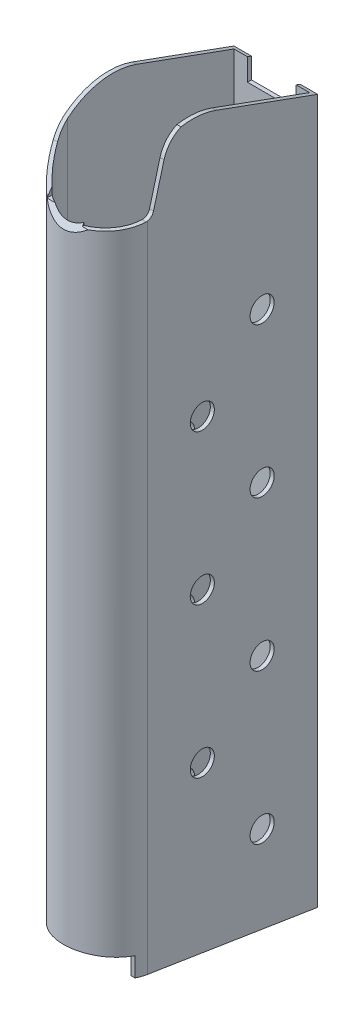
ISO-10303-21;
HEADER;
FILE_DESCRIPTION(('STEP AP214'),'2;1');
FILE_NAME('part.step','',(''),(''),'','','');
FILE_SCHEMA(('AUTOMOTIVE_DESIGN { 1 0 10303 214 1 1 1 1 }'));
ENDSEC;
DATA;
#1=APPLICATION_CONTEXT('core data for automotive mechanical design processes');
#2=APPLICATION_PROTOCOL_DEFINITION('international standard','automotive_design',2000,#1);
#3=PRODUCT_CONTEXT('',#1,'mechanical');
#4=PRODUCT('Part','Part','',(#3));
#5=PRODUCT_RELATED_PRODUCT_CATEGORY('part','',(#4));
#6=PRODUCT_DEFINITION_FORMATION('','',#4);
#7=PRODUCT_DEFINITION_CONTEXT('part definition',#1,'design');
#8=PRODUCT_DEFINITION('design','',#6,#7);
#9=PRODUCT_DEFINITION_SHAPE('','',#8);
#10=(LENGTH_UNIT() NAMED_UNIT(*) SI_UNIT(.MILLI.,.METRE.));
#11=(NAMED_UNIT(*) PLANE_ANGLE_UNIT() SI_UNIT($,.RADIAN.));
#12=(NAMED_UNIT(*) SI_UNIT($,.STERADIAN.) SOLID_ANGLE_UNIT());
#13=UNCERTAINTY_MEASURE_WITH_UNIT(LENGTH_MEASURE(1.E-05),#10,'distance_accuracy_value','');
#14=(GEOMETRIC_REPRESENTATION_CONTEXT(3) GLOBAL_UNCERTAINTY_ASSIGNED_CONTEXT((#13)) GLOBAL_UNIT_ASSIGNED_CONTEXT((#10,
#11,#12)) REPRESENTATION_CONTEXT('',''));
#15=CARTESIAN_POINT('',(0.,0.,0.));
#16=DIRECTION('',(0.,0.,1.));
#17=DIRECTION('',(1.,0.,0.));
#18=AXIS2_PLACEMENT_3D('',#15,#16,#17);
#19=CARTESIAN_POINT('',(4.0005,112.2426,34.8488000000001));
#20=DIRECTION('',(0.,-1.,0.));
#21=DIRECTION('',(0.,0.,-1.));
#22=AXIS2_PLACEMENT_3D('',#19,#20,#21);
#23=PLANE('',#22);
#24=DIRECTION('',(0.,0.,-1.));
#25=VECTOR('',#24,1.);
#26=CARTESIAN_POINT('',(-4.0005,112.2426,34.8488000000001));
#27=LINE('',#26,#25);
#28=CARTESIAN_POINT('',(-4.0005,112.2426,0.660400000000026));
#29=VERTEX_POINT('',#28);
#30=CARTESIAN_POINT('',(-4.0005,112.2426,0.));
#31=VERTEX_POINT('',#30);
#32=EDGE_CURVE('E480',#29,#31,#27,.T.);
#33=ORIENTED_EDGE('',*,*,#32,.F.);
#34=DIRECTION('',(1.,0.,0.));
#35=VECTOR('',#34,1.);
#36=CARTESIAN_POINT('',(4.0005,112.2426,0.660400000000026));
#37=LINE('',#36,#35);
#38=CARTESIAN_POINT('',(4.0005,112.2426,0.660400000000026));
#39=VERTEX_POINT('',#38);
#40=EDGE_CURVE('E435',#29,#39,#37,.T.);
#41=ORIENTED_EDGE('',*,*,#40,.T.);
#42=DIRECTION('',(0.,0.,-1.));
#43=VECTOR('',#42,1.);
#44=CARTESIAN_POINT('',(4.0005,112.2426,34.8488000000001));
#45=LINE('',#44,#43);
#46=CARTESIAN_POINT('',(4.0005,112.2426,0.));
#47=VERTEX_POINT('',#46);
#48=EDGE_CURVE('E481',#39,#47,#45,.T.);
#49=ORIENTED_EDGE('',*,*,#48,.T.);
#50=DIRECTION('',(-1.,0.,0.));
#51=VECTOR('',#50,1.);
#52=CARTESIAN_POINT('',(4.0005,112.2426,0.));
#53=LINE('',#52,#51);
#54=EDGE_CURVE('E463',#47,#31,#53,.T.);
#55=ORIENTED_EDGE('',*,*,#54,.T.);
#56=EDGE_LOOP('',(#33,#41,#49,#55));
#57=FACE_BOUND('',#56,.T.);
#58=ADVANCED_FACE('F35',(#57),#23,.F.);
#59=CARTESIAN_POINT('',(6.8707,4.71491472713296,29.7688));
#60=DIRECTION('',(0.,0.,-1.));
#61=DIRECTION('',(-1.,0.,0.));
#62=AXIS2_PLACEMENT_3D('',#59,#60,#61);
#63=PLANE('',#62);
#64=DIRECTION('',(-1.,0.,0.));
#65=VECTOR('',#64,1.);
#66=CARTESIAN_POINT('',(6.8707,4.71491472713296,29.7688));
#67=LINE('',#66,#65);
#68=CARTESIAN_POINT('',(-5.94653004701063,4.71491472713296,29.7688));
#69=VERTEX_POINT('',#68);
#70=CARTESIAN_POINT('',(-6.6332429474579,4.71491472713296,29.7688));
#71=VERTEX_POINT('',#70);
#72=EDGE_CURVE('E515',#69,#71,#67,.T.);
#73=ORIENTED_EDGE('',*,*,#72,.F.);
#74=DIRECTION('',(0.,1.,0.));
#75=VECTOR('',#74,1.);
#76=CARTESIAN_POINT('',(-5.94653004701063,0.,29.7688));
#77=LINE('',#76,#75);
#78=CARTESIAN_POINT('',(-5.94653004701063,7.88991472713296,29.7688));
#79=VERTEX_POINT('',#78);
#80=EDGE_CURVE('E643',#69,#79,#77,.T.);
#81=ORIENTED_EDGE('',*,*,#80,.T.);
#82=DIRECTION('',(-1.,0.,0.));
#83=VECTOR('',#82,1.);
#84=CARTESIAN_POINT('',(6.8707,7.88991472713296,29.7688));
#85=LINE('',#84,#83);
#86=CARTESIAN_POINT('',(-6.63324294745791,7.88991472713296,29.7688));
#87=VERTEX_POINT('',#86);
#88=EDGE_CURVE('E519',#79,#87,#85,.T.);
#89=ORIENTED_EDGE('',*,*,#88,.T.);
#90=DIRECTION('',(0.,-1.,0.));
#91=VECTOR('',#90,1.);
#92=CARTESIAN_POINT('',(-6.6332429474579,4.43129570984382,29.7688));
#93=LINE('',#92,#91);
#94=EDGE_CURVE('E311',#87,#71,#93,.T.);
#95=ORIENTED_EDGE('',*,*,#94,.T.);
#96=EDGE_LOOP('',(#73,#81,#89,#95));
#97=FACE_BOUND('',#96,.T.);
#98=ADVANCED_FACE('F594',(#97),#63,.F.);
#99=CARTESIAN_POINT('',(-4.0005,112.2426,34.8488000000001));
#100=DIRECTION('',(-1.,0.,0.));
#101=DIRECTION('',(0.,0.,1.));
#102=AXIS2_PLACEMENT_3D('',#99,#100,#101);
#103=PLANE('',#102);
#104=DIRECTION('',(0.,-0.342020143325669,-0.939692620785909));
#105=VECTOR('',#104,1.);
#106=CARTESIAN_POINT('',(-4.0005,121.695594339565,16.6647097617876));
#107=LINE('',#106,#105);
#108=CARTESIAN_POINT('',(-4.0005,115.870501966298,0.660400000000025));
#109=VERTEX_POINT('',#108);
#110=CARTESIAN_POINT('',(-4.0005,115.630136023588,0.));
#111=VERTEX_POINT('',#110);
#112=EDGE_CURVE('E483',#109,#111,#107,.T.);
#113=ORIENTED_EDGE('',*,*,#112,.F.);
#114=DIRECTION('',(0.,-1.,0.));
#115=VECTOR('',#114,1.);
#116=CARTESIAN_POINT('',(-4.0005,112.2426,0.660400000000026));
#117=LINE('',#116,#115);
#118=EDGE_CURVE('E45',#109,#29,#117,.T.);
#119=ORIENTED_EDGE('',*,*,#118,.T.);
#120=ORIENTED_EDGE('',*,*,#32,.T.);
#121=DIRECTION('',(0.,1.,0.));
#122=VECTOR('',#121,1.);
#123=CARTESIAN_POINT('',(-4.0005,112.2426,0.));
#124=LINE('',#123,#122);
#125=EDGE_CURVE('E474',#31,#111,#124,.T.);
#126=ORIENTED_EDGE('',*,*,#125,.T.);
#127=EDGE_LOOP('',(#113,#119,#120,#126));
#128=FACE_BOUND('',#127,.T.);
#129=ADVANCED_FACE('F589',(#128),#103,.F.);
#130=CARTESIAN_POINT('',(0.,4.43129570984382,27.9781));
#131=DIRECTION('',(0.,-1.,0.));
#132=DIRECTION('',(0.,0.,-1.));
#133=AXIS2_PLACEMENT_3D('',#130,#131,#132);
#134=CYLINDRICAL_SURFACE('',#133,6.8707);
#135=DIRECTION('',(0.,-1.,0.));
#136=VECTOR('',#135,1.);
#137=CARTESIAN_POINT('',(-6.8707,110.954907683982,27.9781000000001));
#138=LINE('',#137,#136);
#139=CARTESIAN_POINT('',(-6.8707,4.43129570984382,27.9781));
#140=VERTEX_POINT('',#139);
#141=CARTESIAN_POINT('',(-6.8707,119.662617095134,27.9781000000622));
#142=VERTEX_POINT('',#141);
#143=EDGE_CURVE('E537',#140,#142,#138,.F.);
#144=ORIENTED_EDGE('',*,*,#143,.F.);
#145=CARTESIAN_POINT('',(0.,4.43129570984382,27.9781));
#146=DIRECTION('',(0.,0.987688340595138,-0.156434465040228));
#147=DIRECTION('',(0.,-0.156434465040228,-0.987688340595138));
#148=AXIS2_PLACEMENT_3D('',#145,#146,#147);
#149=ELLIPSE('',#148,6.95634413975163,6.8707);
#150=EDGE_CURVE('E306',#71,#140,#149,.F.);
#151=ORIENTED_EDGE('',*,*,#150,.F.);
#152=ORIENTED_EDGE('',*,*,#94,.F.);
#153=CARTESIAN_POINT('',(0.,7.60629570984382,27.9781));
#154=DIRECTION('',(0.,0.987688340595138,-0.156434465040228));
#155=DIRECTION('',(0.,-0.156434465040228,-0.987688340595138));
#156=AXIS2_PLACEMENT_3D('',#153,#154,#155);
#157=ELLIPSE('',#156,6.95634413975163,6.8707);
#158=CARTESIAN_POINT('',(6.63324294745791,7.88991472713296,29.7688));
#159=VERTEX_POINT('',#158);
#160=EDGE_CURVE('E317',#159,#87,#157,.F.);
#161=ORIENTED_EDGE('',*,*,#160,.F.);
#162=DIRECTION('',(0.,-1.,0.));
#163=VECTOR('',#162,1.);
#164=CARTESIAN_POINT('',(6.6332429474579,4.43129570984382,29.7688));
#165=LINE('',#164,#163);
#166=CARTESIAN_POINT('',(6.6332429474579,4.71491472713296,29.7688));
#167=VERTEX_POINT('',#166);
#168=EDGE_CURVE('E314',#167,#159,#165,.F.);
#169=ORIENTED_EDGE('',*,*,#168,.F.);
#170=CARTESIAN_POINT('',(0.,4.43129570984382,27.9781));
#171=DIRECTION('',(0.,0.987688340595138,-0.156434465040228));
#172=DIRECTION('',(0.,-0.156434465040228,-0.987688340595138));
#173=AXIS2_PLACEMENT_3D('',#170,#171,#172);
#174=ELLIPSE('',#173,6.95634413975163,6.8707);
#175=CARTESIAN_POINT('',(6.8707,4.43129570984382,27.9781));
#176=VERTEX_POINT('',#175);
#177=EDGE_CURVE('E308',#176,#167,#174,.F.);
#178=ORIENTED_EDGE('',*,*,#177,.F.);
#179=DIRECTION('',(0.,1.,0.));
#180=VECTOR('',#179,1.);
#181=CARTESIAN_POINT('',(6.8707,4.43129570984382,27.9781));
#182=LINE('',#181,#180);
#183=CARTESIAN_POINT('',(6.8707,111.580064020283,27.9780999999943));
#184=VERTEX_POINT('',#183);
#185=EDGE_CURVE('E301',#184,#176,#182,.F.);
#186=ORIENTED_EDGE('',*,*,#185,.F.);
#187=CARTESIAN_POINT('',(6.86784153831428,111.564507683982,28.1762693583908));
#188=CARTESIAN_POINT('',(6.86886528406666,111.564503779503,28.1408782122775));
#189=CARTESIAN_POINT('',(6.86961035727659,111.565987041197,28.105479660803));
#190=CARTESIAN_POINT('',(6.87055162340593,111.571881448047,28.0351732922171));
#191=CARTESIAN_POINT('',(6.87075167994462,111.576271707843,28.0002637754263));
#192=CARTESIAN_POINT('',(6.87062556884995,111.587934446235,27.9309308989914));
#193=CARTESIAN_POINT('',(6.8702994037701,111.595206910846,27.8965075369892));
#194=CARTESIAN_POINT('',(6.86914963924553,111.612638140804,27.8281452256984));
#195=CARTESIAN_POINT('',(6.86832249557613,111.622817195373,27.7942115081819));
#196=CARTESIAN_POINT('',(6.86726193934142,111.634398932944,27.7607708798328));
#197=B_SPLINE_CURVE_WITH_KNOTS('',3,(#187,#188,#189,#190,#191,#192,#193,#194,#195,#196),
.UNSPECIFIED.,.F.,.F.,(4,2,2,2,4),(0.,0.106184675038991,0.211614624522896,0.31704406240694,
0.423228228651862),.UNSPECIFIED.);
#198=CARTESIAN_POINT('',(6.86784153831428,111.564507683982,28.1762693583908));
#199=VERTEX_POINT('',#198);
#200=EDGE_CURVE('E294',#199,#184,#197,.T.);
#201=ORIENTED_EDGE('',*,*,#200,.F.);
#202=CARTESIAN_POINT('',(0.,111.564507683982,27.9781000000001));
#203=DIRECTION('',(0.,1.,0.));
#204=DIRECTION('',(0.,0.,1.));
#205=AXIS2_PLACEMENT_3D('',#202,#203,#204);
#206=CIRCLE('',#205,6.8707);
#207=CARTESIAN_POINT('',(3.2023021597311,111.564507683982,34.0568975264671));
#208=VERTEX_POINT('',#207);
#209=EDGE_CURVE('E302',#208,#199,#206,.T.);
#210=ORIENTED_EDGE('',*,*,#209,.F.);
#211=CARTESIAN_POINT('',(0.,120.338398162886,27.9781000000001));
#212=DIRECTION('',(0.,-0.569499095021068,-0.821991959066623));
#213=DIRECTION('',(0.,-0.821991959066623,0.569499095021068));
#214=AXIS2_PLACEMENT_3D('',#211,#212,#213);
#215=ELLIPSE('',#214,12.0644616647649,6.8707);
#216=CARTESIAN_POINT('',(-3.96808275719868,112.2426,33.5870961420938));
#217=VERTEX_POINT('',#216);
#218=EDGE_CURVE('E545',#217,#208,#215,.F.);
#219=ORIENTED_EDGE('',*,*,#218,.F.);
#220=CARTESIAN_POINT('',(0.,112.2426,27.9781000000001));
#221=DIRECTION('',(0.,-1.,0.));
#222=DIRECTION('',(0.,0.,-1.));
#223=AXIS2_PLACEMENT_3D('',#220,#221,#222);
#224=CIRCLE('',#223,6.8707);
#225=CARTESIAN_POINT('',(-4.0005,112.2426,33.5640214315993));
#226=VERTEX_POINT('',#225);
#227=EDGE_CURVE('E553',#226,#217,#224,.F.);
#228=ORIENTED_EDGE('',*,*,#227,.F.);
#229=DIRECTION('',(0.,-1.,0.));
#230=VECTOR('',#229,1.);
#231=CARTESIAN_POINT('',(-4.0005,4.43129570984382,33.5640214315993));
#232=LINE('',#231,#230);
#233=CARTESIAN_POINT('',(-4.0005,112.275905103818,33.5640214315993));
#234=VERTEX_POINT('',#233);
#235=EDGE_CURVE('E551',#234,#226,#232,.T.);
#236=ORIENTED_EDGE('',*,*,#235,.F.);
#237=CARTESIAN_POINT('',(0.,120.338398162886,27.9781000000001));
#238=DIRECTION('',(0.,-0.569499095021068,-0.821991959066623));
#239=DIRECTION('',(0.,-0.821991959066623,0.569499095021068));
#240=AXIS2_PLACEMENT_3D('',#237,#238,#239);
#241=ELLIPSE('',#240,12.0644616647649,6.8707);
#242=CARTESIAN_POINT('',(-6.57581705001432,117.464282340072,29.9693680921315));
#243=VERTEX_POINT('',#242);
#244=EDGE_CURVE('E548',#243,#234,#241,.F.);
#245=ORIENTED_EDGE('',*,*,#244,.F.);
#246=CARTESIAN_POINT('',(-6.48318804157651,117.034666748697,30.252916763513));
#247=CARTESIAN_POINT('',(-6.53711004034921,117.279405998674,30.0991913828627));
#248=CARTESIAN_POINT('',(-6.58829972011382,117.518844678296,29.9358354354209));
#249=CARTESIAN_POINT('',(-6.68087171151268,117.983929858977,29.5918018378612));
#250=CARTESIAN_POINT('',(-6.72232763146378,118.209669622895,29.4112697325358));
#251=CARTESIAN_POINT('',(-6.79206824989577,118.648111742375,29.032334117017));
#252=CARTESIAN_POINT('',(-6.82034850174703,118.860809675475,28.8339246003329));
#253=CARTESIAN_POINT('',(-6.84984608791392,119.169378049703,28.5231471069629));
#254=CARTESIAN_POINT('',(-6.85752926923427,119.270871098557,28.4169105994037));
#255=CARTESIAN_POINT('',(-6.86795619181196,119.469830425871,28.2004420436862));
#256=CARTESIAN_POINT('',(-6.87069843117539,119.567295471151,28.0902087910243));
#257=CARTESIAN_POINT('',(-6.87070000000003,119.662617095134,27.9781000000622));
#258=B_SPLINE_CURVE_WITH_KNOTS('',3,(#246,#247,#248,#249,#250,#251,#252,#253,#254,#255,#256,
#257),.UNSPECIFIED.,.F.,.F.,(4,2,2,2,2,4),(0.,0.881959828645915,1.7570183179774,
2.63237191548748,3.07358049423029,3.51492316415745),.UNSPECIFIED.);
#259=EDGE_CURVE('E540',#142,#243,#258,.F.);
#260=ORIENTED_EDGE('',*,*,#259,.F.);
#261=EDGE_LOOP('',(#144,#151,#152,#161,#169,#178,#186,#201,#210,#219,#228,#236,#245,#260));
#262=FACE_BOUND('',#261,.T.);
#263=ADVANCED_FACE('F37',(#262),#134,.T.);
#264=CARTESIAN_POINT('',(6.8707,110.421507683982,34.8488000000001));
#265=DIRECTION('',(0.,-0.569499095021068,-0.821991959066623));
#266=DIRECTION('',(0.,0.821991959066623,-0.569499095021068));
#267=AXIS2_PLACEMENT_3D('',#264,#265,#266);
#268=PLANE('',#267);
#269=DIRECTION('',(0.,0.821991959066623,-0.569499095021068));
#270=VECTOR('',#269,1.);
#271=CARTESIAN_POINT('',(-4.0005,110.421507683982,34.8488000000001));
#272=LINE('',#271,#270);
#273=CARTESIAN_POINT('',(-4.0005,113.482238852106,32.7282395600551));
#274=VERTEX_POINT('',#273);
#275=EDGE_CURVE('E532',#234,#274,#272,.T.);
#276=ORIENTED_EDGE('',*,*,#275,.T.);
#277=CARTESIAN_POINT('',(0.,120.338398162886,27.9781000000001));
#278=DIRECTION('',(0.,-0.569499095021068,-0.821991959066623));
#279=DIRECTION('',(0.,0.821991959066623,-0.569499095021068));
#280=AXIS2_PLACEMENT_3D('',#277,#278,#279);
#281=ELLIPSE('',#280,10.9048461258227,6.2103);
#282=CARTESIAN_POINT('',(-5.88240405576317,117.464282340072,29.9693680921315));
#283=VERTEX_POINT('',#282);
#284=EDGE_CURVE('E244',#274,#283,#281,.T.);
#285=ORIENTED_EDGE('',*,*,#284,.T.);
#286=DIRECTION('',(-1.,0.,0.));
#287=VECTOR('',#286,1.);
#288=CARTESIAN_POINT('',(6.8707,117.464282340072,29.9693680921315));
#289=LINE('',#288,#287);
#290=EDGE_CURVE('E242',#283,#243,#289,.T.);
#291=ORIENTED_EDGE('',*,*,#290,.T.);
#292=ORIENTED_EDGE('',*,*,#244,.T.);
#293=EDGE_LOOP('',(#276,#285,#291,#292));
#294=FACE_BOUND('',#293,.T.);
#295=ADVANCED_FACE('F581',(#294),#268,.F.);
#296=CARTESIAN_POINT('',(6.8707,110.954907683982,20.574));
#297=DIRECTION('',(-1.,0.,0.));
#298=DIRECTION('',(0.,0.,1.));
#299=AXIS2_PLACEMENT_3D('',#296,#297,#298);
#300=CYLINDRICAL_SURFACE('',#299,11.43);
#301=DIRECTION('',(-1.,0.,0.));
#302=VECTOR('',#301,1.);
#303=CARTESIAN_POINT('',(6.8707,121.695594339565,16.6647097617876));
#304=LINE('',#303,#302);
#305=CARTESIAN_POINT('',(6.8707,121.695594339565,16.6647097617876));
#306=VERTEX_POINT('',#305);
#307=CARTESIAN_POINT('',(6.2103,121.695594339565,16.6647097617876));
#308=VERTEX_POINT('',#307);
#309=EDGE_CURVE('E525',#306,#308,#304,.T.);
#310=ORIENTED_EDGE('',*,*,#309,.T.);
#311=CARTESIAN_POINT('',(6.2103,110.954907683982,20.574));
#312=DIRECTION('',(1.,0.,0.));
#313=DIRECTION('',(0.,0.,-1.));
#314=AXIS2_PLACEMENT_3D('',#311,#312,#313);
#315=CIRCLE('',#314,11.43);
#316=CARTESIAN_POINT('',(6.2103,122.228792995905,22.4566603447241));
#317=VERTEX_POINT('',#316);
#318=EDGE_CURVE('E420',#308,#317,#315,.T.);
#319=ORIENTED_EDGE('',*,*,#318,.T.);
#320=DIRECTION('',(1.,0.,0.));
#321=VECTOR('',#320,1.);
#322=CARTESIAN_POINT('',(2.27330000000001,122.228792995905,22.4566603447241));
#323=LINE('',#322,#321);
#324=CARTESIAN_POINT('',(6.8707,122.228792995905,22.4566603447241));
#325=VERTEX_POINT('',#324);
#326=EDGE_CURVE('E467',#317,#325,#323,.T.);
#327=ORIENTED_EDGE('',*,*,#326,.T.);
#328=CARTESIAN_POINT('',(6.8707,110.954907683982,20.574));
#329=DIRECTION('',(1.,0.,0.));
#330=DIRECTION('',(0.,0.,-1.));
#331=AXIS2_PLACEMENT_3D('',#328,#329,#330);
#332=CIRCLE('',#331,11.43);
#333=EDGE_CURVE('E498',#306,#325,#332,.T.);
#334=ORIENTED_EDGE('',*,*,#333,.F.);
#335=EDGE_LOOP('',(#310,#319,#327,#334));
#336=FACE_BOUND('',#335,.T.);
#337=ADVANCED_FACE('F583',(#336),#300,.T.);
#338=DIRECTION('',(0.,-0.821991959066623,0.569499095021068));
#339=VECTOR('',#338,1.);
#340=CARTESIAN_POINT('',(2.27330000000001,131.71537266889,20.0958128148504));
#341=LINE('',#340,#339);
#342=CARTESIAN_POINT('',(2.27330000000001,111.996837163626,33.7573675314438));
#343=VERTEX_POINT('',#342);
#344=CARTESIAN_POINT('',(2.27330000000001,111.564507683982,34.0568975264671));
#345=VERTEX_POINT('',#344);
#346=EDGE_CURVE('E448',#343,#345,#341,.T.);
#347=ORIENTED_EDGE('',*,*,#346,.F.);
#348=CARTESIAN_POINT('',(0.,120.338398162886,27.9781000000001));
#349=DIRECTION('',(0.,-0.569499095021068,-0.821991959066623));
#350=DIRECTION('',(0.,0.821991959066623,-0.569499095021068));
#351=AXIS2_PLACEMENT_3D('',#348,#349,#350);
#352=ELLIPSE('',#351,10.9048461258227,6.2103);
#353=CARTESIAN_POINT('',(-2.6658935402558,112.2426,33.5870961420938));
#354=VERTEX_POINT('',#353);
#355=EDGE_CURVE('E570',#343,#354,#352,.T.);
#356=ORIENTED_EDGE('',*,*,#355,.T.);
#357=DIRECTION('',(-1.,0.,0.));
#358=VECTOR('',#357,1.);
#359=CARTESIAN_POINT('',(6.8707,112.2426,33.5870961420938));
#360=LINE('',#359,#358);
#361=EDGE_CURVE('E535',#354,#217,#360,.T.);
#362=ORIENTED_EDGE('',*,*,#361,.T.);
#363=ORIENTED_EDGE('',*,*,#218,.T.);
#364=DIRECTION('',(1.,0.,0.));
#365=VECTOR('',#364,1.);
#366=CARTESIAN_POINT('',(2.27330000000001,111.564507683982,34.0568975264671));
#367=LINE('',#366,#365);
#368=EDGE_CURVE('E464',#345,#208,#367,.T.);
#369=ORIENTED_EDGE('',*,*,#368,.F.);
#370=EDGE_LOOP('',(#347,#356,#362,#363,#369));
#371=FACE_BOUND('',#370,.T.);
#372=ADVANCED_FACE('F568',(#371),#268,.F.);
#373=CARTESIAN_POINT('',(6.8707,110.954907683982,20.574));
#374=DIRECTION('',(1.,0.,0.));
#375=DIRECTION('',(0.,0.,-1.));
#376=AXIS2_PLACEMENT_3D('',#373,#374,#375);
#377=PLANE('',#376);
#378=CARTESIAN_POINT('',(6.8707,15.7019105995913,9.1186));
#379=DIRECTION('',(1.,0.,0.));
#380=DIRECTION('',(0.,0.,-1.));
#381=AXIS2_PLACEMENT_3D('',#378,#379,#380);
#382=CIRCLE('',#381,1.9812);
#383=CARTESIAN_POINT('',(6.8707,15.7019105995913,7.1374));
#384=VERTEX_POINT('',#383);
#385=EDGE_CURVE('E976',#384,#384,#382,.T.);
#386=ORIENTED_EDGE('',*,*,#385,.F.);
#387=EDGE_LOOP('',(#386));
#388=FACE_BOUND('',#387,.T.);
#389=CARTESIAN_POINT('',(6.8707,30.0305076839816,18.9454251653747));
#390=DIRECTION('',(1.,0.,0.));
#391=DIRECTION('',(0.,0.,-1.));
#392=AXIS2_PLACEMENT_3D('',#389,#390,#391);
#393=CIRCLE('',#392,1.9812);
#394=CARTESIAN_POINT('',(6.8707,30.0305076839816,16.9642251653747));
#395=VERTEX_POINT('',#394);
#396=EDGE_CURVE('E361',#395,#395,#393,.T.);
#397=ORIENTED_EDGE('',*,*,#396,.F.);
#398=EDGE_LOOP('',(#397));
#399=FACE_BOUND('',#398,.T.);
#400=CARTESIAN_POINT('',(6.8707,79.3065076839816,18.9454251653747));
#401=DIRECTION('',(-1.,0.,0.));
#402=DIRECTION('',(0.,0.,1.));
#403=AXIS2_PLACEMENT_3D('',#400,#401,#402);
#404=CIRCLE('',#403,1.9812);
#405=CARTESIAN_POINT('',(6.8707,79.3065076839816,20.9266251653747));
#406=VERTEX_POINT('',#405);
#407=EDGE_CURVE('E350',#406,#406,#404,.T.);
#408=ORIENTED_EDGE('',*,*,#407,.T.);
#409=EDGE_LOOP('',(#408));
#410=FACE_BOUND('',#409,.T.);
#411=CARTESIAN_POINT('',(6.8707,54.6685076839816,18.9454251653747));
#412=DIRECTION('',(-1.,0.,0.));
#413=DIRECTION('',(0.,0.,1.));
#414=AXIS2_PLACEMENT_3D('',#411,#412,#413);
#415=CIRCLE('',#414,1.9812);
#416=CARTESIAN_POINT('',(6.8707,54.6685076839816,20.9266251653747));
#417=VERTEX_POINT('',#416);
#418=EDGE_CURVE('E346',#417,#417,#415,.T.);
#419=ORIENTED_EDGE('',*,*,#418,.T.);
#420=EDGE_LOOP('',(#419));
#421=FACE_BOUND('',#420,.T.);
#422=CARTESIAN_POINT('',(6.8707,40.3399105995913,9.1186));
#423=DIRECTION('',(-1.,0.,0.));
#424=DIRECTION('',(0.,0.,1.));
#425=AXIS2_PLACEMENT_3D('',#422,#423,#424);
#426=CIRCLE('',#425,1.9812);
#427=CARTESIAN_POINT('',(6.8707,40.3399105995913,11.0998));
#428=VERTEX_POINT('',#427);
#429=EDGE_CURVE('E341',#428,#428,#426,.T.);
#430=ORIENTED_EDGE('',*,*,#429,.T.);
#431=EDGE_LOOP('',(#430));
#432=FACE_BOUND('',#431,.T.);
#433=CARTESIAN_POINT('',(6.8707,64.9779105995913,9.1186));
#434=DIRECTION('',(-1.,0.,0.));
#435=DIRECTION('',(0.,0.,1.));
#436=AXIS2_PLACEMENT_3D('',#433,#434,#435);
#437=CIRCLE('',#436,1.9812);
#438=CARTESIAN_POINT('',(6.8707,64.9779105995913,11.0998));
#439=VERTEX_POINT('',#438);
#440=EDGE_CURVE('E336',#439,#439,#437,.T.);
#441=ORIENTED_EDGE('',*,*,#440,.T.);
#442=EDGE_LOOP('',(#441));
#443=FACE_BOUND('',#442,.T.);
#444=CARTESIAN_POINT('',(6.8707,89.6159105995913,9.1186));
#445=DIRECTION('',(-1.,0.,0.));
#446=DIRECTION('',(0.,0.,1.));
#447=AXIS2_PLACEMENT_3D('',#444,#445,#446);
#448=CIRCLE('',#447,1.9812);
#449=CARTESIAN_POINT('',(6.8707,89.6159105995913,11.0998));
#450=VERTEX_POINT('',#449);
#451=EDGE_CURVE('E331',#450,#450,#448,.T.);
#452=ORIENTED_EDGE('',*,*,#451,.T.);
#453=EDGE_LOOP('',(#452));
#454=FACE_BOUND('',#453,.T.);
#455=CARTESIAN_POINT('',(6.8707,112.834507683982,28.1762693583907));
#456=DIRECTION('',(1.,0.,0.));
#457=DIRECTION('',(0.,0.,-1.));
#458=AXIS2_PLACEMENT_3D('',#455,#456,#457);
#459=CIRCLE('',#458,1.27);
#460=CARTESIAN_POINT('',(6.8707,112.505807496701,26.9495435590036));
#461=VERTEX_POINT('',#460);
#462=EDGE_CURVE('E447',#461,#184,#459,.F.);
#463=ORIENTED_EDGE('',*,*,#462,.T.);
#464=ORIENTED_EDGE('',*,*,#185,.T.);
#465=DIRECTION('',(0.,-0.156434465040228,-0.987688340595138));
#466=VECTOR('',#465,1.);
#467=CARTESIAN_POINT('',(6.8707,0.,0.));
#468=LINE('',#467,#466);
#469=CARTESIAN_POINT('',(6.8707,0.,0.));
#470=VERTEX_POINT('',#469);
#471=EDGE_CURVE('E501',#176,#470,#468,.T.);
#472=ORIENTED_EDGE('',*,*,#471,.T.);
#473=DIRECTION('',(0.,1.,0.));
#474=VECTOR('',#473,1.);
#475=CARTESIAN_POINT('',(6.8707,0.,0.));
#476=LINE('',#475,#474);
#477=CARTESIAN_POINT('',(6.8707,115.630136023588,0.));
#478=VERTEX_POINT('',#477);
#479=EDGE_CURVE('E492',#470,#478,#476,.T.);
#480=ORIENTED_EDGE('',*,*,#479,.T.);
#481=DIRECTION('',(0.,0.342020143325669,0.939692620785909));
#482=VECTOR('',#481,1.);
#483=CARTESIAN_POINT('',(6.8707,121.695594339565,16.6647097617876));
#484=LINE('',#483,#482);
#485=EDGE_CURVE('E495',#478,#306,#484,.T.);
#486=ORIENTED_EDGE('',*,*,#485,.T.);
#487=ORIENTED_EDGE('',*,*,#333,.T.);
#488=CARTESIAN_POINT('',(6.8707,117.6199880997,20.32));
#489=DIRECTION('',(1.,0.,0.));
#490=DIRECTION('',(0.,0.,-1.));
#491=AXIS2_PLACEMENT_3D('',#488,#489,#490);
#492=CIRCLE('',#491,5.08);
#493=CARTESIAN_POINT('',(6.8707,118.934788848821,25.2269031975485));
#494=VERTEX_POINT('',#493);
#495=EDGE_CURVE('E451',#325,#494,#492,.T.);
#496=ORIENTED_EDGE('',*,*,#495,.T.);
#497=DIRECTION('',(0.,0.965925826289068,-0.258819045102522));
#498=VECTOR('',#497,1.);
#499=CARTESIAN_POINT('',(6.8707,91.7907115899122,32.5001367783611));
#500=LINE('',#499,#498);
#501=EDGE_CURVE('E456',#461,#494,#500,.T.);
#502=ORIENTED_EDGE('',*,*,#501,.F.);
#503=EDGE_LOOP('',(#463,#464,#472,#480,#486,#487,#496,#502));
#504=FACE_BOUND('',#503,.T.);
#505=ADVANCED_FACE('F592',(#388,#399,#410,#421,#432,#443,#454,#504),#377,.T.);
#506=ORIENTED_EDGE('',*,*,#361,.F.);
#507=CARTESIAN_POINT('',(0.,112.2426,27.9781000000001));
#508=DIRECTION('',(0.,-1.,0.));
#509=DIRECTION('',(0.,0.,-1.));
#510=AXIS2_PLACEMENT_3D('',#507,#508,#509);
#511=CIRCLE('',#510,6.2103);
#512=CARTESIAN_POINT('',(-4.0005,112.2426,32.7282395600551));
#513=VERTEX_POINT('',#512);
#514=EDGE_CURVE('E573',#354,#513,#511,.T.);
#515=ORIENTED_EDGE('',*,*,#514,.T.);
#516=EDGE_CURVE('E484',#226,#513,#27,.T.);
#517=ORIENTED_EDGE('',*,*,#516,.F.);
#518=ORIENTED_EDGE('',*,*,#227,.T.);
#519=EDGE_LOOP('',(#506,#515,#517,#518));
#520=FACE_BOUND('',#519,.T.);
#521=ADVANCED_FACE('F572',(#520),#23,.F.);
#522=CARTESIAN_POINT('',(4.0005,112.2426,34.8488000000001));
#523=DIRECTION('',(1.,0.,0.));
#524=DIRECTION('',(0.,0.,-1.));
#525=AXIS2_PLACEMENT_3D('',#522,#523,#524);
#526=PLANE('',#525);
#527=ORIENTED_EDGE('',*,*,#48,.F.);
#528=DIRECTION('',(0.,1.,0.));
#529=VECTOR('',#528,1.);
#530=CARTESIAN_POINT('',(4.0005,112.2426,0.660400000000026));
#531=LINE('',#530,#529);
#532=CARTESIAN_POINT('',(4.0005,115.870501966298,0.660400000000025));
#533=VERTEX_POINT('',#532);
#534=EDGE_CURVE('E438',#39,#533,#531,.T.);
#535=ORIENTED_EDGE('',*,*,#534,.T.);
#536=DIRECTION('',(0.,0.342020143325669,0.939692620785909));
#537=VECTOR('',#536,1.);
#538=CARTESIAN_POINT('',(4.0005,121.695594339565,16.6647097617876));
#539=LINE('',#538,#537);
#540=CARTESIAN_POINT('',(4.0005,115.630136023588,0.));
#541=VERTEX_POINT('',#540);
#542=EDGE_CURVE('E488',#541,#533,#539,.T.);
#543=ORIENTED_EDGE('',*,*,#542,.F.);
#544=DIRECTION('',(0.,-1.,0.));
#545=VECTOR('',#544,1.);
#546=CARTESIAN_POINT('',(4.0005,112.2426,0.));
#547=LINE('',#546,#545);
#548=EDGE_CURVE('E477',#541,#47,#547,.T.);
#549=ORIENTED_EDGE('',*,*,#548,.T.);
#550=EDGE_LOOP('',(#527,#535,#543,#549));
#551=FACE_BOUND('',#550,.T.);
#552=ADVANCED_FACE('F290',(#551),#526,.F.);
#553=CARTESIAN_POINT('',(6.8707,121.695594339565,16.6647097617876));
#554=DIRECTION('',(0.,-0.939692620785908,0.342020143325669));
#555=DIRECTION('',(0.,-0.342020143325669,-0.939692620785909));
#556=AXIS2_PLACEMENT_3D('',#553,#554,#555);
#557=PLANE('',#556);
#558=ORIENTED_EDGE('',*,*,#542,.T.);
#559=DIRECTION('',(1.,0.,0.));
#560=VECTOR('',#559,1.);
#561=CARTESIAN_POINT('',(6.8707,115.870501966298,0.660400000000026));
#562=LINE('',#561,#560);
#563=CARTESIAN_POINT('',(6.2103,115.870501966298,0.660400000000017));
#564=VERTEX_POINT('',#563);
#565=EDGE_CURVE('E441',#533,#564,#562,.T.);
#566=ORIENTED_EDGE('',*,*,#565,.T.);
#567=DIRECTION('',(0.,0.342020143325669,0.939692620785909));
#568=VECTOR('',#567,1.);
#569=CARTESIAN_POINT('',(6.2103,121.695594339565,16.6647097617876));
#570=LINE('',#569,#568);
#571=EDGE_CURVE('E424',#564,#308,#570,.T.);
#572=ORIENTED_EDGE('',*,*,#571,.T.);
#573=ORIENTED_EDGE('',*,*,#309,.F.);
#574=ORIENTED_EDGE('',*,*,#485,.F.);
#575=DIRECTION('',(-1.,0.,0.));
#576=VECTOR('',#575,1.);
#577=CARTESIAN_POINT('',(6.8707,115.630136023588,0.));
#578=LINE('',#577,#576);
#579=EDGE_CURVE('E529',#478,#541,#578,.T.);
#580=ORIENTED_EDGE('',*,*,#579,.T.);
#581=EDGE_LOOP('',(#558,#566,#572,#573,#574,#580));
#582=FACE_BOUND('',#581,.T.);
#583=ADVANCED_FACE('F610',(#582),#557,.F.);
#584=CARTESIAN_POINT('',(6.8707,0.,0.));
#585=DIRECTION('',(0.,0.,1.));
#586=DIRECTION('',(0.,-1.,0.));
#587=AXIS2_PLACEMENT_3D('',#584,#585,#586);
#588=PLANE('',#587);
#589=ORIENTED_EDGE('',*,*,#54,.F.);
#590=ORIENTED_EDGE('',*,*,#548,.F.);
#591=ORIENTED_EDGE('',*,*,#579,.F.);
#592=ORIENTED_EDGE('',*,*,#479,.F.);
#593=DIRECTION('',(-1.,0.,0.));
#594=VECTOR('',#593,1.);
#595=CARTESIAN_POINT('',(6.8707,0.,0.));
#596=LINE('',#595,#594);
#597=CARTESIAN_POINT('',(-6.8707,0.,0.));
#598=VERTEX_POINT('',#597);
#599=EDGE_CURVE('E503',#470,#598,#596,.T.);
#600=ORIENTED_EDGE('',*,*,#599,.T.);
#601=DIRECTION('',(0.,1.,0.));
#602=VECTOR('',#601,1.);
#603=CARTESIAN_POINT('',(-6.8707,0.,0.));
#604=LINE('',#603,#602);
#605=CARTESIAN_POINT('',(-6.8707,115.630136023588,0.));
#606=VERTEX_POINT('',#605);
#607=EDGE_CURVE('E491',#598,#606,#604,.T.);
#608=ORIENTED_EDGE('',*,*,#607,.T.);
#609=EDGE_CURVE('E528',#111,#606,#578,.T.);
#610=ORIENTED_EDGE('',*,*,#609,.F.);
#611=ORIENTED_EDGE('',*,*,#125,.F.);
#612=EDGE_LOOP('',(#589,#590,#591,#592,#600,#608,#610,#611));
#613=FACE_BOUND('',#612,.T.);
#614=ADVANCED_FACE('F677',(#613),#588,.F.);
#615=DIRECTION('',(0.,-0.342020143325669,-0.939692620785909));
#616=VECTOR('',#615,1.);
#617=CARTESIAN_POINT('',(-6.2103,121.695594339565,16.6647097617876));
#618=LINE('',#617,#616);
#619=CARTESIAN_POINT('',(-6.2103,121.695594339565,16.6647097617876));
#620=VERTEX_POINT('',#619);
#621=CARTESIAN_POINT('',(-6.2103,115.870501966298,0.660400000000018));
#622=VERTEX_POINT('',#621);
#623=EDGE_CURVE('E225',#620,#622,#618,.T.);
#624=ORIENTED_EDGE('',*,*,#623,.T.);
#625=DIRECTION('',(1.,0.,0.));
#626=VECTOR('',#625,1.);
#627=CARTESIAN_POINT('',(6.8707,115.870501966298,0.660400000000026));
#628=LINE('',#627,#626);
#629=EDGE_CURVE('E432',#622,#109,#628,.T.);
#630=ORIENTED_EDGE('',*,*,#629,.T.);
#631=ORIENTED_EDGE('',*,*,#112,.T.);
#632=ORIENTED_EDGE('',*,*,#609,.T.);
#633=DIRECTION('',(0.,0.342020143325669,0.939692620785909));
#634=VECTOR('',#633,1.);
#635=CARTESIAN_POINT('',(-6.8707,121.695594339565,16.6647097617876));
#636=LINE('',#635,#634);
#637=CARTESIAN_POINT('',(-6.8707,121.695594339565,16.6647097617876));
#638=VERTEX_POINT('',#637);
#639=EDGE_CURVE('E506',#606,#638,#636,.T.);
#640=ORIENTED_EDGE('',*,*,#639,.T.);
#641=EDGE_CURVE('E524',#620,#638,#304,.T.);
#642=ORIENTED_EDGE('',*,*,#641,.F.);
#643=EDGE_LOOP('',(#624,#630,#631,#632,#640,#642));
#644=FACE_BOUND('',#643,.T.);
#645=ADVANCED_FACE('F634',(#644),#557,.F.);
#646=ORIENTED_EDGE('',*,*,#290,.F.);
#647=CARTESIAN_POINT('',(-5.88240405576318,117.464282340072,29.9693680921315));
#648=CARTESIAN_POINT('',(-5.92980221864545,117.666437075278,29.8293172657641));
#649=CARTESIAN_POINT('',(-5.97399600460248,117.864657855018,29.6823178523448));
#650=CARTESIAN_POINT('',(-6.05302439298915,118.251007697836,29.3758307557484));
#651=CARTESIAN_POINT('',(-6.08791713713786,118.439193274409,29.2164291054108));
#652=CARTESIAN_POINT('',(-6.14607671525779,118.805914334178,28.8846948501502));
#653=CARTESIAN_POINT('',(-6.16934033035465,118.984447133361,28.7123586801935));
#654=CARTESIAN_POINT('',(-6.20149185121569,119.331644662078,28.3546142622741));
#655=CARTESIAN_POINT('',(-6.21028604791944,119.500238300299,28.1691288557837));
#656=CARTESIAN_POINT('',(-6.2103,119.662617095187,27.9781000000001));
#657=B_SPLINE_CURVE_WITH_KNOTS('',3,(#647,#648,#649,#650,#651,#652,#653,#654,#655,#656),
.UNSPECIFIED.,.F.,.F.,(4,2,2,2,4),(0.,0.751368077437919,1.49792285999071,2.24468417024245,
2.99626300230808),.UNSPECIFIED.);
#658=CARTESIAN_POINT('',(-6.2103,119.662617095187,27.9781000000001));
#659=VERTEX_POINT('',#658);
#660=EDGE_CURVE('E232',#283,#659,#657,.T.);
#661=ORIENTED_EDGE('',*,*,#660,.T.);
#662=CARTESIAN_POINT('',(-6.2103,110.954907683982,20.574));
#663=DIRECTION('',(-1.,0.,0.));
#664=DIRECTION('',(0.,0.,1.));
#665=AXIS2_PLACEMENT_3D('',#662,#663,#664);
#666=CIRCLE('',#665,11.43);
#667=EDGE_CURVE('E221',#659,#620,#666,.T.);
#668=ORIENTED_EDGE('',*,*,#667,.T.);
#669=ORIENTED_EDGE('',*,*,#641,.T.);
#670=CARTESIAN_POINT('',(-6.8707,110.954907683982,20.574));
#671=DIRECTION('',(1.,0.,0.));
#672=DIRECTION('',(0.,0.,-1.));
#673=AXIS2_PLACEMENT_3D('',#670,#671,#672);
#674=CIRCLE('',#673,11.43);
#675=EDGE_CURVE('E509',#638,#142,#674,.T.);
#676=ORIENTED_EDGE('',*,*,#675,.T.);
#677=ORIENTED_EDGE('',*,*,#259,.T.);
#678=EDGE_LOOP('',(#646,#661,#668,#669,#676,#677));
#679=FACE_BOUND('',#678,.T.);
#680=ADVANCED_FACE('F240',(#679),#300,.T.);
#681=CARTESIAN_POINT('',(6.8707,7.88991472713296,29.7688));
#682=DIRECTION('',(0.,0.987688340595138,-0.156434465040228));
#683=DIRECTION('',(0.,0.156434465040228,0.987688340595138));
#684=AXIS2_PLACEMENT_3D('',#681,#682,#683);
#685=PLANE('',#684);
#686=ORIENTED_EDGE('',*,*,#88,.F.);
#687=CARTESIAN_POINT('',(0.,7.60629570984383,27.9781000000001));
#688=DIRECTION('',(0.,0.987688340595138,-0.156434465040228));
#689=DIRECTION('',(0.,0.156434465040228,0.987688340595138));
#690=AXIS2_PLACEMENT_3D('',#687,#688,#689);
#691=ELLIPSE('',#690,6.28771217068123,6.2103);
#692=CARTESIAN_POINT('',(5.94653004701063,7.88991472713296,29.7688));
#693=VERTEX_POINT('',#692);
#694=EDGE_CURVE('E638',#79,#693,#691,.T.);
#695=ORIENTED_EDGE('',*,*,#694,.T.);
#696=EDGE_CURVE('E520',#159,#693,#85,.T.);
#697=ORIENTED_EDGE('',*,*,#696,.F.);
#698=ORIENTED_EDGE('',*,*,#160,.T.);
#699=EDGE_LOOP('',(#686,#695,#697,#698));
#700=FACE_BOUND('',#699,.T.);
#701=ADVANCED_FACE('F627',(#700),#685,.F.);
#702=ORIENTED_EDGE('',*,*,#696,.T.);
#703=DIRECTION('',(0.,1.,0.));
#704=VECTOR('',#703,1.);
#705=CARTESIAN_POINT('',(5.94653004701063,0.,29.7688));
#706=LINE('',#705,#704);
#707=CARTESIAN_POINT('',(5.94653004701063,4.71491472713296,29.7688));
#708=VERTEX_POINT('',#707);
#709=EDGE_CURVE('E247',#693,#708,#706,.F.);
#710=ORIENTED_EDGE('',*,*,#709,.T.);
#711=EDGE_CURVE('E516',#167,#708,#67,.T.);
#712=ORIENTED_EDGE('',*,*,#711,.F.);
#713=ORIENTED_EDGE('',*,*,#168,.T.);
#714=EDGE_LOOP('',(#702,#710,#712,#713));
#715=FACE_BOUND('',#714,.T.);
#716=ADVANCED_FACE('F602',(#715),#63,.F.);
#717=CARTESIAN_POINT('',(6.8707,0.,0.));
#718=DIRECTION('',(0.,0.987688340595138,-0.156434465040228));
#719=DIRECTION('',(0.,0.156434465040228,0.987688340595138));
#720=AXIS2_PLACEMENT_3D('',#717,#718,#719);
#721=PLANE('',#720);
#722=ORIENTED_EDGE('',*,*,#711,.T.);
#723=CARTESIAN_POINT('',(0.,4.43129570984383,27.9781000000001));
#724=DIRECTION('',(0.,0.987688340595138,-0.156434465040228));
#725=DIRECTION('',(0.,0.156434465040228,0.987688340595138));
#726=AXIS2_PLACEMENT_3D('',#723,#724,#725);
#727=ELLIPSE('',#726,6.28771217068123,6.2103);
#728=CARTESIAN_POINT('',(6.2103,4.43129570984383,27.9781000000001));
#729=VERTEX_POINT('',#728);
#730=EDGE_CURVE('E243',#708,#729,#727,.T.);
#731=ORIENTED_EDGE('',*,*,#730,.T.);
#732=DIRECTION('',(0.,-0.156434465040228,-0.987688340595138));
#733=VECTOR('',#732,1.);
#734=CARTESIAN_POINT('',(6.2103,0.,0.));
#735=LINE('',#734,#733);
#736=CARTESIAN_POINT('',(6.2103,0.104597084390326,0.660400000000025));
#737=VERTEX_POINT('',#736);
#738=EDGE_CURVE('E414',#729,#737,#735,.T.);
#739=ORIENTED_EDGE('',*,*,#738,.T.);
#740=DIRECTION('',(-1.,0.,0.));
#741=VECTOR('',#740,1.);
#742=CARTESIAN_POINT('',(6.8707,0.104597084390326,0.660400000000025));
#743=LINE('',#742,#741);
#744=CARTESIAN_POINT('',(-6.2103,0.104597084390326,0.660400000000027));
#745=VERTEX_POINT('',#744);
#746=EDGE_CURVE('E229',#737,#745,#743,.T.);
#747=ORIENTED_EDGE('',*,*,#746,.T.);
#748=DIRECTION('',(0.,0.156434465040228,0.987688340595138));
#749=VECTOR('',#748,1.);
#750=CARTESIAN_POINT('',(-6.2103,0.,0.));
#751=LINE('',#750,#749);
#752=CARTESIAN_POINT('',(-6.2103,4.43129570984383,27.9781000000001));
#753=VERTEX_POINT('',#752);
#754=EDGE_CURVE('E11',#745,#753,#751,.T.);
#755=ORIENTED_EDGE('',*,*,#754,.T.);
#756=EDGE_CURVE('E235',#753,#69,#727,.T.);
#757=ORIENTED_EDGE('',*,*,#756,.T.);
#758=ORIENTED_EDGE('',*,*,#72,.T.);
#759=ORIENTED_EDGE('',*,*,#150,.T.);
#760=DIRECTION('',(0.,-0.156434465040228,-0.987688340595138));
#761=VECTOR('',#760,1.);
#762=CARTESIAN_POINT('',(-6.8707,0.,0.));
#763=LINE('',#762,#761);
#764=EDGE_CURVE('E496',#140,#598,#763,.T.);
#765=ORIENTED_EDGE('',*,*,#764,.T.);
#766=ORIENTED_EDGE('',*,*,#599,.F.);
#767=ORIENTED_EDGE('',*,*,#471,.F.);
#768=ORIENTED_EDGE('',*,*,#177,.T.);
#769=EDGE_LOOP('',(#722,#731,#739,#747,#755,#757,#758,#759,#765,#766,#767,#768));
#770=FACE_BOUND('',#769,.T.);
#771=ADVANCED_FACE('F622',(#770),#721,.F.);
#772=CARTESIAN_POINT('',(-6.8707,110.954907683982,20.574));
#773=DIRECTION('',(1.,0.,0.));
#774=DIRECTION('',(0.,0.,-1.));
#775=AXIS2_PLACEMENT_3D('',#772,#773,#774);
#776=PLANE('',#775);
#777=CARTESIAN_POINT('',(-6.8707,15.7019105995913,9.1186));
#778=DIRECTION('',(1.,0.,0.));
#779=DIRECTION('',(0.,0.,-1.));
#780=AXIS2_PLACEMENT_3D('',#777,#778,#779);
#781=CIRCLE('',#780,1.9812);
#782=CARTESIAN_POINT('',(-6.8707,15.7019105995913,7.1374));
#783=VERTEX_POINT('',#782);
#784=EDGE_CURVE('E969',#783,#783,#781,.T.);
#785=ORIENTED_EDGE('',*,*,#784,.T.);
#786=EDGE_LOOP('',(#785));
#787=FACE_BOUND('',#786,.T.);
#788=CARTESIAN_POINT('',(-6.8707,30.0305076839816,18.9454251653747));
#789=DIRECTION('',(1.,0.,0.));
#790=DIRECTION('',(0.,0.,-1.));
#791=AXIS2_PLACEMENT_3D('',#788,#789,#790);
#792=CIRCLE('',#791,1.9812);
#793=CARTESIAN_POINT('',(-6.8707,30.0305076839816,16.9642251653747));
#794=VERTEX_POINT('',#793);
#795=EDGE_CURVE('E354',#794,#794,#792,.T.);
#796=ORIENTED_EDGE('',*,*,#795,.T.);
#797=EDGE_LOOP('',(#796));
#798=FACE_BOUND('',#797,.T.);
#799=CARTESIAN_POINT('',(-6.8707,79.3065076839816,18.9454251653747));
#800=DIRECTION('',(-1.,0.,0.));
#801=DIRECTION('',(0.,0.,1.));
#802=AXIS2_PLACEMENT_3D('',#799,#800,#801);
#803=CIRCLE('',#802,1.9812);
#804=CARTESIAN_POINT('',(-6.8707,79.3065076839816,20.9266251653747));
#805=VERTEX_POINT('',#804);
#806=EDGE_CURVE('E358',#805,#805,#803,.T.);
#807=ORIENTED_EDGE('',*,*,#806,.F.);
#808=EDGE_LOOP('',(#807));
#809=FACE_BOUND('',#808,.T.);
#810=CARTESIAN_POINT('',(-6.8707,54.6685076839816,18.9454251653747));
#811=DIRECTION('',(-1.,0.,0.));
#812=DIRECTION('',(0.,0.,1.));
#813=AXIS2_PLACEMENT_3D('',#810,#811,#812);
#814=CIRCLE('',#813,1.9812);
#815=CARTESIAN_POINT('',(-6.8707,54.6685076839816,20.9266251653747));
#816=VERTEX_POINT('',#815);
#817=EDGE_CURVE('E377',#816,#816,#814,.T.);
#818=ORIENTED_EDGE('',*,*,#817,.F.);
#819=EDGE_LOOP('',(#818));
#820=FACE_BOUND('',#819,.T.);
#821=CARTESIAN_POINT('',(-6.8707,40.3399105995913,9.1186));
#822=DIRECTION('',(-1.,0.,0.));
#823=DIRECTION('',(0.,0.,1.));
#824=AXIS2_PLACEMENT_3D('',#821,#822,#823);
#825=CIRCLE('',#824,1.9812);
#826=CARTESIAN_POINT('',(-6.8707,40.3399105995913,11.0998));
#827=VERTEX_POINT('',#826);
#828=EDGE_CURVE('E384',#827,#827,#825,.T.);
#829=ORIENTED_EDGE('',*,*,#828,.F.);
#830=EDGE_LOOP('',(#829));
#831=FACE_BOUND('',#830,.T.);
#832=CARTESIAN_POINT('',(-6.8707,64.9779105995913,9.1186));
#833=DIRECTION('',(-1.,0.,0.));
#834=DIRECTION('',(0.,0.,1.));
#835=AXIS2_PLACEMENT_3D('',#832,#833,#834);
#836=CIRCLE('',#835,1.9812);
#837=CARTESIAN_POINT('',(-6.8707,64.9779105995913,11.0998));
#838=VERTEX_POINT('',#837);
#839=EDGE_CURVE('E391',#838,#838,#836,.T.);
#840=ORIENTED_EDGE('',*,*,#839,.F.);
#841=EDGE_LOOP('',(#840));
#842=FACE_BOUND('',#841,.T.);
#843=CARTESIAN_POINT('',(-6.8707,89.6159105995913,9.1186));
#844=DIRECTION('',(-1.,0.,0.));
#845=DIRECTION('',(0.,0.,1.));
#846=AXIS2_PLACEMENT_3D('',#843,#844,#845);
#847=CIRCLE('',#846,1.9812);
#848=CARTESIAN_POINT('',(-6.8707,89.6159105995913,11.0998));
#849=VERTEX_POINT('',#848);
#850=EDGE_CURVE('E398',#849,#849,#847,.T.);
#851=ORIENTED_EDGE('',*,*,#850,.F.);
#852=EDGE_LOOP('',(#851));
#853=FACE_BOUND('',#852,.T.);
#854=ORIENTED_EDGE('',*,*,#764,.F.);
#855=ORIENTED_EDGE('',*,*,#143,.T.);
#856=ORIENTED_EDGE('',*,*,#675,.F.);
#857=ORIENTED_EDGE('',*,*,#639,.F.);
#858=ORIENTED_EDGE('',*,*,#607,.F.);
#859=EDGE_LOOP('',(#854,#855,#856,#857,#858));
#860=FACE_BOUND('',#859,.T.);
#861=ADVANCED_FACE('F620',(#787,#798,#809,#820,#831,#842,#853,#860),#776,.F.);
#862=ORIENTED_EDGE('',*,*,#516,.T.);
#863=DIRECTION('',(0.,1.,0.));
#864=VECTOR('',#863,1.);
#865=CARTESIAN_POINT('',(-4.0005,0.,32.7282395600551));
#866=LINE('',#865,#864);
#867=EDGE_CURVE('E249',#513,#274,#866,.T.);
#868=ORIENTED_EDGE('',*,*,#867,.T.);
#869=ORIENTED_EDGE('',*,*,#275,.F.);
#870=ORIENTED_EDGE('',*,*,#235,.T.);
#871=EDGE_LOOP('',(#862,#868,#869,#870));
#872=FACE_BOUND('',#871,.T.);
#873=ADVANCED_FACE('F577',(#872),#103,.F.);
#874=CARTESIAN_POINT('',(2.27330000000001,61.1924538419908,-81.6941157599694));
#875=DIRECTION('',(1.,0.,0.));
#876=DIRECTION('',(0.,0.,-1.));
#877=AXIS2_PLACEMENT_3D('',#874,#875,#876);
#878=PLANE('',#877);
#879=DIRECTION('',(0.,1.,0.));
#880=VECTOR('',#879,1.);
#881=CARTESIAN_POINT('',(2.27330000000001,0.,33.7573675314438));
#882=LINE('',#881,#880);
#883=CARTESIAN_POINT('',(2.27330000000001,111.564507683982,33.7573675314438));
#884=VERTEX_POINT('',#883);
#885=EDGE_CURVE('E61',#343,#884,#882,.F.);
#886=ORIENTED_EDGE('',*,*,#885,.F.);
#887=ORIENTED_EDGE('',*,*,#346,.T.);
#888=DIRECTION('',(0.,0.,1.));
#889=VECTOR('',#888,1.);
#890=CARTESIAN_POINT('',(2.27330000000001,111.564507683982,-81.6941157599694));
#891=LINE('',#890,#889);
#892=EDGE_CURVE('E450',#884,#345,#891,.T.);
#893=ORIENTED_EDGE('',*,*,#892,.F.);
#894=EDGE_LOOP('',(#886,#887,#893));
#895=FACE_BOUND('',#894,.T.);
#896=ADVANCED_FACE('F286',(#895),#878,.T.);
#897=CARTESIAN_POINT('',(2.27330000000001,112.834507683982,28.1762693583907));
#898=DIRECTION('',(1.,0.,0.));
#899=DIRECTION('',(0.,0.,-1.));
#900=AXIS2_PLACEMENT_3D('',#897,#898,#899);
#901=CYLINDRICAL_SURFACE('',#900,1.27);
#902=CARTESIAN_POINT('',(6.2103,112.834507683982,28.1762693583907));
#903=DIRECTION('',(1.,0.,0.));
#904=DIRECTION('',(0.,0.,-1.));
#905=AXIS2_PLACEMENT_3D('',#902,#903,#904);
#906=CIRCLE('',#905,1.27);
#907=CARTESIAN_POINT('',(6.2103,111.580064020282,27.9781000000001));
#908=VERTEX_POINT('',#907);
#909=CARTESIAN_POINT('',(6.2103,112.505807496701,26.9495435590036));
#910=VERTEX_POINT('',#909);
#911=EDGE_CURVE('E411',#908,#910,#906,.T.);
#912=ORIENTED_EDGE('',*,*,#911,.F.);
#913=CARTESIAN_POINT('',(6.20713742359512,111.564507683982,28.1762693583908));
#914=CARTESIAN_POINT('',(6.20819482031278,111.564511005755,28.1430463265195));
#915=CARTESIAN_POINT('',(6.20898706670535,111.565809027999,28.1099206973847));
#916=CARTESIAN_POINT('',(6.21004125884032,111.570994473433,28.0438642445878));
#917=CARTESIAN_POINT('',(6.21030320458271,111.574881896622,28.0109334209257));
#918=CARTESIAN_POINT('',(6.2103,111.580064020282,27.9781000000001));
#919=B_SPLINE_CURVE_WITH_KNOTS('',3,(#913,#914,#915,#916,#917,#918),.UNSPECIFIED.,.F.,.F.,(4,2,
4),(0.,0.0994815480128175,0.198963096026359),.UNSPECIFIED.);
#920=CARTESIAN_POINT('',(6.20713742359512,111.564507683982,28.1762693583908));
#921=VERTEX_POINT('',#920);
#922=EDGE_CURVE('E271',#921,#908,#919,.T.);
#923=ORIENTED_EDGE('',*,*,#922,.F.);
#924=DIRECTION('',(1.,0.,0.));
#925=VECTOR('',#924,1.);
#926=CARTESIAN_POINT('',(2.27330000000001,111.564507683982,28.1762693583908));
#927=LINE('',#926,#925);
#928=EDGE_CURVE('E461',#921,#199,#927,.T.);
#929=ORIENTED_EDGE('',*,*,#928,.T.);
#930=ORIENTED_EDGE('',*,*,#200,.T.);
#931=ORIENTED_EDGE('',*,*,#462,.F.);
#932=DIRECTION('',(1.,0.,0.));
#933=VECTOR('',#932,1.);
#934=CARTESIAN_POINT('',(2.27330000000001,112.505807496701,26.9495435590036));
#935=LINE('',#934,#933);
#936=EDGE_CURVE('E419',#910,#461,#935,.T.);
#937=ORIENTED_EDGE('',*,*,#936,.F.);
#938=EDGE_LOOP('',(#912,#923,#929,#930,#931,#937));
#939=FACE_BOUND('',#938,.T.);
#940=ADVANCED_FACE('F280',(#939),#901,.F.);
#941=CARTESIAN_POINT('',(2.27330000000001,117.6199880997,20.32));
#942=DIRECTION('',(1.,0.,0.));
#943=DIRECTION('',(0.,0.,-1.));
#944=AXIS2_PLACEMENT_3D('',#941,#942,#943);
#945=CYLINDRICAL_SURFACE('',#944,5.08);
#946=CARTESIAN_POINT('',(6.2103,117.6199880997,20.32));
#947=DIRECTION('',(1.,0.,0.));
#948=DIRECTION('',(0.,0.,-1.));
#949=AXIS2_PLACEMENT_3D('',#946,#947,#948);
#950=CIRCLE('',#949,5.08);
#951=CARTESIAN_POINT('',(6.2103,118.934788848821,25.2269031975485));
#952=VERTEX_POINT('',#951);
#953=EDGE_CURVE('E421',#952,#317,#950,.F.);
#954=ORIENTED_EDGE('',*,*,#953,.F.);
#955=DIRECTION('',(1.,0.,0.));
#956=VECTOR('',#955,1.);
#957=CARTESIAN_POINT('',(2.27330000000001,118.934788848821,25.2269031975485));
#958=LINE('',#957,#956);
#959=EDGE_CURVE('E469',#952,#494,#958,.T.);
#960=ORIENTED_EDGE('',*,*,#959,.T.);
#961=ORIENTED_EDGE('',*,*,#495,.F.);
#962=ORIENTED_EDGE('',*,*,#326,.F.);
#963=EDGE_LOOP('',(#954,#960,#961,#962));
#964=FACE_BOUND('',#963,.T.);
#965=ADVANCED_FACE('F285',(#964),#945,.T.);
#966=CARTESIAN_POINT('',(2.27330000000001,91.7907115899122,32.5001367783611));
#967=DIRECTION('',(0.,-0.258819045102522,-0.965925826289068));
#968=DIRECTION('',(0.,0.965925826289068,-0.258819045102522));
#969=AXIS2_PLACEMENT_3D('',#966,#967,#968);
#970=PLANE('',#969);
#971=ORIENTED_EDGE('',*,*,#959,.F.);
#972=DIRECTION('',(0.,-0.965925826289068,0.258819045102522));
#973=VECTOR('',#972,1.);
#974=CARTESIAN_POINT('',(6.2103,91.7907115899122,32.5001367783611));
#975=LINE('',#974,#973);
#976=EDGE_CURVE('E322',#952,#910,#975,.T.);
#977=ORIENTED_EDGE('',*,*,#976,.T.);
#978=ORIENTED_EDGE('',*,*,#936,.T.);
#979=ORIENTED_EDGE('',*,*,#501,.T.);
#980=EDGE_LOOP('',(#971,#977,#978,#979));
#981=FACE_BOUND('',#980,.T.);
#982=ADVANCED_FACE('F288',(#981),#970,.F.);
#983=CARTESIAN_POINT('',(2.27330000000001,111.564507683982,-81.6941157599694));
#984=DIRECTION('',(0.,1.,0.));
#985=DIRECTION('',(0.,0.,1.));
#986=AXIS2_PLACEMENT_3D('',#983,#984,#985);
#987=PLANE('',#986);
#988=CARTESIAN_POINT('',(0.,111.564507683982,27.9781000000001));
#989=DIRECTION('',(0.,1.,0.));
#990=DIRECTION('',(0.,0.,1.));
#991=AXIS2_PLACEMENT_3D('',#988,#989,#990);
#992=CIRCLE('',#991,6.2103);
#993=EDGE_CURVE('E320',#884,#921,#992,.T.);
#994=ORIENTED_EDGE('',*,*,#993,.F.);
#995=ORIENTED_EDGE('',*,*,#892,.T.);
#996=ORIENTED_EDGE('',*,*,#368,.T.);
#997=ORIENTED_EDGE('',*,*,#209,.T.);
#998=ORIENTED_EDGE('',*,*,#928,.F.);
#999=EDGE_LOOP('',(#994,#995,#996,#997,#998));
#1000=FACE_BOUND('',#999,.T.);
#1001=ADVANCED_FACE('F561',(#1000),#987,.T.);
#1002=CARTESIAN_POINT('',(-6.2103,0.,27.9781000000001));
#1003=DIRECTION('',(-1.,0.,0.));
#1004=DIRECTION('',(0.,0.,1.));
#1005=AXIS2_PLACEMENT_3D('',#1002,#1003,#1004);
#1006=PLANE('',#1005);
#1007=CARTESIAN_POINT('',(-6.2103,15.7019105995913,9.1186));
#1008=DIRECTION('',(-1.,0.,0.));
#1009=DIRECTION('',(0.,0.,1.));
#1010=AXIS2_PLACEMENT_3D('',#1007,#1008,#1009);
#1011=CIRCLE('',#1010,1.9812);
#1012=CARTESIAN_POINT('',(-6.2103,15.7019105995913,11.0998));
#1013=VERTEX_POINT('',#1012);
#1014=EDGE_CURVE('E366',#1013,#1013,#1011,.T.);
#1015=ORIENTED_EDGE('',*,*,#1014,.T.);
#1016=EDGE_LOOP('',(#1015));
#1017=FACE_BOUND('',#1016,.T.);
#1018=CARTESIAN_POINT('',(-6.2103,30.0305076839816,18.9454251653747));
#1019=DIRECTION('',(-1.,0.,0.));
#1020=DIRECTION('',(0.,0.,1.));
#1021=AXIS2_PLACEMENT_3D('',#1018,#1019,#1020);
#1022=CIRCLE('',#1021,1.9812);
#1023=CARTESIAN_POINT('',(-6.2103,30.0305076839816,20.9266251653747));
#1024=VERTEX_POINT('',#1023);
#1025=EDGE_CURVE('E353',#1024,#1024,#1022,.T.);
#1026=ORIENTED_EDGE('',*,*,#1025,.T.);
#1027=EDGE_LOOP('',(#1026));
#1028=FACE_BOUND('',#1027,.T.);
#1029=CARTESIAN_POINT('',(-6.2103,79.3065076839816,18.9454251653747));
#1030=DIRECTION('',(-1.,0.,0.));
#1031=DIRECTION('',(0.,0.,1.));
#1032=AXIS2_PLACEMENT_3D('',#1029,#1030,#1031);
#1033=CIRCLE('',#1032,1.9812);
#1034=CARTESIAN_POINT('',(-6.2103,79.3065076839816,20.9266251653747));
#1035=VERTEX_POINT('',#1034);
#1036=EDGE_CURVE('E349',#1035,#1035,#1033,.T.);
#1037=ORIENTED_EDGE('',*,*,#1036,.T.);
#1038=EDGE_LOOP('',(#1037));
#1039=FACE_BOUND('',#1038,.T.);
#1040=CARTESIAN_POINT('',(-6.2103,54.6685076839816,18.9454251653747));
#1041=DIRECTION('',(-1.,0.,0.));
#1042=DIRECTION('',(0.,0.,1.));
#1043=AXIS2_PLACEMENT_3D('',#1040,#1041,#1042);
#1044=CIRCLE('',#1043,1.9812);
#1045=CARTESIAN_POINT('',(-6.2103,54.6685076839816,20.9266251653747));
#1046=VERTEX_POINT('',#1045);
#1047=EDGE_CURVE('E345',#1046,#1046,#1044,.T.);
#1048=ORIENTED_EDGE('',*,*,#1047,.T.);
#1049=EDGE_LOOP('',(#1048));
#1050=FACE_BOUND('',#1049,.T.);
#1051=CARTESIAN_POINT('',(-6.2103,40.3399105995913,9.1186));
#1052=DIRECTION('',(-1.,0.,0.));
#1053=DIRECTION('',(0.,0.,1.));
#1054=AXIS2_PLACEMENT_3D('',#1051,#1052,#1053);
#1055=CIRCLE('',#1054,1.9812);
#1056=CARTESIAN_POINT('',(-6.2103,40.3399105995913,11.0998));
#1057=VERTEX_POINT('',#1056);
#1058=EDGE_CURVE('E340',#1057,#1057,#1055,.T.);
#1059=ORIENTED_EDGE('',*,*,#1058,.T.);
#1060=EDGE_LOOP('',(#1059));
#1061=FACE_BOUND('',#1060,.T.);
#1062=CARTESIAN_POINT('',(-6.2103,64.9779105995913,9.1186));
#1063=DIRECTION('',(-1.,0.,0.));
#1064=DIRECTION('',(0.,0.,1.));
#1065=AXIS2_PLACEMENT_3D('',#1062,#1063,#1064);
#1066=CIRCLE('',#1065,1.9812);
#1067=CARTESIAN_POINT('',(-6.2103,64.9779105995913,11.0998));
#1068=VERTEX_POINT('',#1067);
#1069=EDGE_CURVE('E335',#1068,#1068,#1066,.T.);
#1070=ORIENTED_EDGE('',*,*,#1069,.T.);
#1071=EDGE_LOOP('',(#1070));
#1072=FACE_BOUND('',#1071,.T.);
#1073=CARTESIAN_POINT('',(-6.2103,89.6159105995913,9.1186));
#1074=DIRECTION('',(-1.,0.,0.));
#1075=DIRECTION('',(0.,0.,1.));
#1076=AXIS2_PLACEMENT_3D('',#1073,#1074,#1075);
#1077=CIRCLE('',#1076,1.9812);
#1078=CARTESIAN_POINT('',(-6.2103,89.6159105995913,11.0998));
#1079=VERTEX_POINT('',#1078);
#1080=EDGE_CURVE('E330',#1079,#1079,#1077,.T.);
#1081=ORIENTED_EDGE('',*,*,#1080,.T.);
#1082=EDGE_LOOP('',(#1081));
#1083=FACE_BOUND('',#1082,.T.);
#1084=ORIENTED_EDGE('',*,*,#667,.F.);
#1085=DIRECTION('',(0.,1.,0.));
#1086=VECTOR('',#1085,1.);
#1087=CARTESIAN_POINT('',(-6.2103,0.,27.9781000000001));
#1088=LINE('',#1087,#1086);
#1089=EDGE_CURVE('E53',#753,#659,#1088,.T.);
#1090=ORIENTED_EDGE('',*,*,#1089,.F.);
#1091=ORIENTED_EDGE('',*,*,#754,.F.);
#1092=DIRECTION('',(0.,1.,0.));
#1093=VECTOR('',#1092,1.);
#1094=CARTESIAN_POINT('',(-6.2103,0.,0.660400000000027));
#1095=LINE('',#1094,#1093);
#1096=EDGE_CURVE('E237',#745,#622,#1095,.T.);
#1097=ORIENTED_EDGE('',*,*,#1096,.T.);
#1098=ORIENTED_EDGE('',*,*,#623,.F.);
#1099=EDGE_LOOP('',(#1084,#1090,#1091,#1097,#1098));
#1100=FACE_BOUND('',#1099,.T.);
#1101=ADVANCED_FACE('F222',(#1017,#1028,#1039,#1050,#1061,#1072,#1083,#1100),#1006,.F.);
#1102=CARTESIAN_POINT('',(-6.2103,0.,0.660400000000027));
#1103=DIRECTION('',(0.,0.,-1.));
#1104=DIRECTION('',(-1.,0.,0.));
#1105=AXIS2_PLACEMENT_3D('',#1102,#1103,#1104);
#1106=PLANE('',#1105);
#1107=DIRECTION('',(0.,1.,0.));
#1108=VECTOR('',#1107,1.);
#1109=CARTESIAN_POINT('',(6.2103,0.,0.660400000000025));
#1110=LINE('',#1109,#1108);
#1111=EDGE_CURVE('E278',#737,#564,#1110,.T.);
#1112=ORIENTED_EDGE('',*,*,#1111,.T.);
#1113=ORIENTED_EDGE('',*,*,#565,.F.);
#1114=ORIENTED_EDGE('',*,*,#534,.F.);
#1115=ORIENTED_EDGE('',*,*,#40,.F.);
#1116=ORIENTED_EDGE('',*,*,#118,.F.);
#1117=ORIENTED_EDGE('',*,*,#629,.F.);
#1118=ORIENTED_EDGE('',*,*,#1096,.F.);
#1119=ORIENTED_EDGE('',*,*,#746,.F.);
#1120=EDGE_LOOP('',(#1112,#1113,#1114,#1115,#1116,#1117,#1118,#1119));
#1121=FACE_BOUND('',#1120,.T.);
#1122=ADVANCED_FACE('F661',(#1121),#1106,.F.);
#1123=CARTESIAN_POINT('',(6.2103,0.,0.660400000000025));
#1124=DIRECTION('',(1.,0.,0.));
#1125=DIRECTION('',(0.,0.,-1.));
#1126=AXIS2_PLACEMENT_3D('',#1123,#1124,#1125);
#1127=PLANE('',#1126);
#1128=CARTESIAN_POINT('',(6.2103,15.7019105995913,9.1186));
#1129=DIRECTION('',(1.,0.,0.));
#1130=DIRECTION('',(0.,0.,-1.));
#1131=AXIS2_PLACEMENT_3D('',#1128,#1129,#1130);
#1132=CIRCLE('',#1131,1.9812);
#1133=CARTESIAN_POINT('',(6.2103,15.7019105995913,7.1374));
#1134=VERTEX_POINT('',#1133);
#1135=EDGE_CURVE('E40',#1134,#1134,#1132,.T.);
#1136=ORIENTED_EDGE('',*,*,#1135,.T.);
#1137=EDGE_LOOP('',(#1136));
#1138=FACE_BOUND('',#1137,.T.);
#1139=CARTESIAN_POINT('',(6.2103,30.0305076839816,18.9454251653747));
#1140=DIRECTION('',(1.,0.,0.));
#1141=DIRECTION('',(0.,0.,-1.));
#1142=AXIS2_PLACEMENT_3D('',#1139,#1140,#1141);
#1143=CIRCLE('',#1142,1.9812);
#1144=CARTESIAN_POINT('',(6.2103,30.0305076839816,16.9642251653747));
#1145=VERTEX_POINT('',#1144);
#1146=EDGE_CURVE('E351',#1145,#1145,#1143,.T.);
#1147=ORIENTED_EDGE('',*,*,#1146,.T.);
#1148=EDGE_LOOP('',(#1147));
#1149=FACE_BOUND('',#1148,.T.);
#1150=CARTESIAN_POINT('',(6.2103,79.3065076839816,18.9454251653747));
#1151=DIRECTION('',(1.,0.,0.));
#1152=DIRECTION('',(0.,0.,-1.));
#1153=AXIS2_PLACEMENT_3D('',#1150,#1151,#1152);
#1154=CIRCLE('',#1153,1.9812);
#1155=CARTESIAN_POINT('',(6.2103,79.3065076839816,16.9642251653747));
#1156=VERTEX_POINT('',#1155);
#1157=EDGE_CURVE('E347',#1156,#1156,#1154,.T.);
#1158=ORIENTED_EDGE('',*,*,#1157,.T.);
#1159=EDGE_LOOP('',(#1158));
#1160=FACE_BOUND('',#1159,.T.);
#1161=CARTESIAN_POINT('',(6.2103,54.6685076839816,18.9454251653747));
#1162=DIRECTION('',(1.,0.,0.));
#1163=DIRECTION('',(0.,0.,-1.));
#1164=AXIS2_PLACEMENT_3D('',#1161,#1162,#1163);
#1165=CIRCLE('',#1164,1.9812);
#1166=CARTESIAN_POINT('',(6.2103,54.6685076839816,16.9642251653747));
#1167=VERTEX_POINT('',#1166);
#1168=EDGE_CURVE('E342',#1167,#1167,#1165,.T.);
#1169=ORIENTED_EDGE('',*,*,#1168,.T.);
#1170=EDGE_LOOP('',(#1169));
#1171=FACE_BOUND('',#1170,.T.);
#1172=CARTESIAN_POINT('',(6.2103,40.3399105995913,9.1186));
#1173=DIRECTION('',(1.,0.,0.));
#1174=DIRECTION('',(0.,0.,-1.));
#1175=AXIS2_PLACEMENT_3D('',#1172,#1173,#1174);
#1176=CIRCLE('',#1175,1.9812);
#1177=CARTESIAN_POINT('',(6.2103,40.3399105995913,7.1374));
#1178=VERTEX_POINT('',#1177);
#1179=EDGE_CURVE('E337',#1178,#1178,#1176,.T.);
#1180=ORIENTED_EDGE('',*,*,#1179,.T.);
#1181=EDGE_LOOP('',(#1180));
#1182=FACE_BOUND('',#1181,.T.);
#1183=CARTESIAN_POINT('',(6.2103,64.9779105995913,9.1186));
#1184=DIRECTION('',(1.,0.,0.));
#1185=DIRECTION('',(0.,0.,-1.));
#1186=AXIS2_PLACEMENT_3D('',#1183,#1184,#1185);
#1187=CIRCLE('',#1186,1.9812);
#1188=CARTESIAN_POINT('',(6.2103,64.9779105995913,7.1374));
#1189=VERTEX_POINT('',#1188);
#1190=EDGE_CURVE('E332',#1189,#1189,#1187,.T.);
#1191=ORIENTED_EDGE('',*,*,#1190,.T.);
#1192=EDGE_LOOP('',(#1191));
#1193=FACE_BOUND('',#1192,.T.);
#1194=CARTESIAN_POINT('',(6.2103,89.6159105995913,9.1186));
#1195=DIRECTION('',(1.,0.,0.));
#1196=DIRECTION('',(0.,0.,-1.));
#1197=AXIS2_PLACEMENT_3D('',#1194,#1195,#1196);
#1198=CIRCLE('',#1197,1.9812);
#1199=CARTESIAN_POINT('',(6.2103,89.6159105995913,7.1374));
#1200=VERTEX_POINT('',#1199);
#1201=EDGE_CURVE('E327',#1200,#1200,#1198,.T.);
#1202=ORIENTED_EDGE('',*,*,#1201,.T.);
#1203=EDGE_LOOP('',(#1202));
#1204=FACE_BOUND('',#1203,.T.);
#1205=DIRECTION('',(0.,1.,0.));
#1206=VECTOR('',#1205,1.);
#1207=CARTESIAN_POINT('',(6.2103,0.,27.9781000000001));
#1208=LINE('',#1207,#1206);
#1209=EDGE_CURVE('E236',#729,#908,#1208,.T.);
#1210=ORIENTED_EDGE('',*,*,#1209,.T.);
#1211=ORIENTED_EDGE('',*,*,#911,.T.);
#1212=ORIENTED_EDGE('',*,*,#976,.F.);
#1213=ORIENTED_EDGE('',*,*,#953,.T.);
#1214=ORIENTED_EDGE('',*,*,#318,.F.);
#1215=ORIENTED_EDGE('',*,*,#571,.F.);
#1216=ORIENTED_EDGE('',*,*,#1111,.F.);
#1217=ORIENTED_EDGE('',*,*,#738,.F.);
#1218=EDGE_LOOP('',(#1210,#1211,#1212,#1213,#1214,#1215,#1216,#1217));
#1219=FACE_BOUND('',#1218,.T.);
#1220=ADVANCED_FACE('F266',(#1138,#1149,#1160,#1171,#1182,#1193,#1204,#1219),#1127,.F.);
#1221=CARTESIAN_POINT('',(0.,0.,27.9781000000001));
#1222=DIRECTION('',(0.,1.,0.));
#1223=DIRECTION('',(0.,0.,1.));
#1224=AXIS2_PLACEMENT_3D('',#1221,#1222,#1223);
#1225=CYLINDRICAL_SURFACE('',#1224,6.2103);
#1226=ORIENTED_EDGE('',*,*,#1089,.T.);
#1227=ORIENTED_EDGE('',*,*,#660,.F.);
#1228=ORIENTED_EDGE('',*,*,#284,.F.);
#1229=ORIENTED_EDGE('',*,*,#867,.F.);
#1230=ORIENTED_EDGE('',*,*,#514,.F.);
#1231=ORIENTED_EDGE('',*,*,#355,.F.);
#1232=ORIENTED_EDGE('',*,*,#885,.T.);
#1233=ORIENTED_EDGE('',*,*,#993,.T.);
#1234=ORIENTED_EDGE('',*,*,#922,.T.);
#1235=ORIENTED_EDGE('',*,*,#1209,.F.);
#1236=ORIENTED_EDGE('',*,*,#730,.F.);
#1237=ORIENTED_EDGE('',*,*,#709,.F.);
#1238=ORIENTED_EDGE('',*,*,#694,.F.);
#1239=ORIENTED_EDGE('',*,*,#80,.F.);
#1240=ORIENTED_EDGE('',*,*,#756,.F.);
#1241=EDGE_LOOP('',(#1226,#1227,#1228,#1229,#1230,#1231,#1232,#1233,#1234,#1235,#1236,#1237,
#1238,#1239,#1240));
#1242=FACE_BOUND('',#1241,.T.);
#1243=ADVANCED_FACE('F231',(#1242),#1225,.F.);
#1244=CARTESIAN_POINT('',(6.8707,89.6159105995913,9.1186));
#1245=DIRECTION('',(-1.,0.,0.));
#1246=DIRECTION('',(0.,0.,1.));
#1247=AXIS2_PLACEMENT_3D('',#1244,#1245,#1246);
#1248=CYLINDRICAL_SURFACE('',#1247,1.9812);
#1249=ORIENTED_EDGE('',*,*,#451,.F.);
#1250=EDGE_LOOP('',(#1249));
#1251=FACE_BOUND('',#1250,.T.);
#1252=ORIENTED_EDGE('',*,*,#1201,.F.);
#1253=EDGE_LOOP('',(#1252));
#1254=FACE_BOUND('',#1253,.T.);
#1255=ADVANCED_FACE('F265',(#1251,#1254),#1248,.F.);
#1256=ORIENTED_EDGE('',*,*,#850,.T.);
#1257=EDGE_LOOP('',(#1256));
#1258=FACE_BOUND('',#1257,.T.);
#1259=ORIENTED_EDGE('',*,*,#1080,.F.);
#1260=EDGE_LOOP('',(#1259));
#1261=FACE_BOUND('',#1260,.T.);
#1262=ADVANCED_FACE('F840',(#1258,#1261),#1248,.F.);
#1263=CARTESIAN_POINT('',(6.8707,64.9779105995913,9.1186));
#1264=DIRECTION('',(-1.,0.,0.));
#1265=DIRECTION('',(0.,0.,1.));
#1266=AXIS2_PLACEMENT_3D('',#1263,#1264,#1265);
#1267=CYLINDRICAL_SURFACE('',#1266,1.9812);
#1268=ORIENTED_EDGE('',*,*,#440,.F.);
#1269=EDGE_LOOP('',(#1268));
#1270=FACE_BOUND('',#1269,.T.);
#1271=ORIENTED_EDGE('',*,*,#1190,.F.);
#1272=EDGE_LOOP('',(#1271));
#1273=FACE_BOUND('',#1272,.T.);
#1274=ADVANCED_FACE('F849',(#1270,#1273),#1267,.F.);
#1275=ORIENTED_EDGE('',*,*,#839,.T.);
#1276=EDGE_LOOP('',(#1275));
#1277=FACE_BOUND('',#1276,.T.);
#1278=ORIENTED_EDGE('',*,*,#1069,.F.);
#1279=EDGE_LOOP('',(#1278));
#1280=FACE_BOUND('',#1279,.T.);
#1281=ADVANCED_FACE('F858',(#1277,#1280),#1267,.F.);
#1282=CARTESIAN_POINT('',(6.8707,40.3399105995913,9.1186));
#1283=DIRECTION('',(-1.,0.,0.));
#1284=DIRECTION('',(0.,0.,1.));
#1285=AXIS2_PLACEMENT_3D('',#1282,#1283,#1284);
#1286=CYLINDRICAL_SURFACE('',#1285,1.9812);
#1287=ORIENTED_EDGE('',*,*,#429,.F.);
#1288=EDGE_LOOP('',(#1287));
#1289=FACE_BOUND('',#1288,.T.);
#1290=ORIENTED_EDGE('',*,*,#1179,.F.);
#1291=EDGE_LOOP('',(#1290));
#1292=FACE_BOUND('',#1291,.T.);
#1293=ADVANCED_FACE('F868',(#1289,#1292),#1286,.F.);
#1294=ORIENTED_EDGE('',*,*,#828,.T.);
#1295=EDGE_LOOP('',(#1294));
#1296=FACE_BOUND('',#1295,.T.);
#1297=ORIENTED_EDGE('',*,*,#1058,.F.);
#1298=EDGE_LOOP('',(#1297));
#1299=FACE_BOUND('',#1298,.T.);
#1300=ADVANCED_FACE('F877',(#1296,#1299),#1286,.F.);
#1301=CARTESIAN_POINT('',(6.8707,54.6685076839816,18.9454251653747));
#1302=DIRECTION('',(-1.,0.,0.));
#1303=DIRECTION('',(0.,0.,1.));
#1304=AXIS2_PLACEMENT_3D('',#1301,#1302,#1303);
#1305=CYLINDRICAL_SURFACE('',#1304,1.9812);
#1306=ORIENTED_EDGE('',*,*,#418,.F.);
#1307=EDGE_LOOP('',(#1306));
#1308=FACE_BOUND('',#1307,.T.);
#1309=ORIENTED_EDGE('',*,*,#1168,.F.);
#1310=EDGE_LOOP('',(#1309));
#1311=FACE_BOUND('',#1310,.T.);
#1312=ADVANCED_FACE('F887',(#1308,#1311),#1305,.F.);
#1313=ORIENTED_EDGE('',*,*,#817,.T.);
#1314=EDGE_LOOP('',(#1313));
#1315=FACE_BOUND('',#1314,.T.);
#1316=ORIENTED_EDGE('',*,*,#1047,.F.);
#1317=EDGE_LOOP('',(#1316));
#1318=FACE_BOUND('',#1317,.T.);
#1319=ADVANCED_FACE('F896',(#1315,#1318),#1305,.F.);
#1320=CARTESIAN_POINT('',(6.8707,79.3065076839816,18.9454251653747));
#1321=DIRECTION('',(-1.,0.,0.));
#1322=DIRECTION('',(0.,0.,1.));
#1323=AXIS2_PLACEMENT_3D('',#1320,#1321,#1322);
#1324=CYLINDRICAL_SURFACE('',#1323,1.9812);
#1325=ORIENTED_EDGE('',*,*,#407,.F.);
#1326=EDGE_LOOP('',(#1325));
#1327=FACE_BOUND('',#1326,.T.);
#1328=ORIENTED_EDGE('',*,*,#1157,.F.);
#1329=EDGE_LOOP('',(#1328));
#1330=FACE_BOUND('',#1329,.T.);
#1331=ADVANCED_FACE('F906',(#1327,#1330),#1324,.F.);
#1332=ORIENTED_EDGE('',*,*,#806,.T.);
#1333=EDGE_LOOP('',(#1332));
#1334=FACE_BOUND('',#1333,.T.);
#1335=ORIENTED_EDGE('',*,*,#1036,.F.);
#1336=EDGE_LOOP('',(#1335));
#1337=FACE_BOUND('',#1336,.T.);
#1338=ADVANCED_FACE('F914',(#1334,#1337),#1324,.F.);
#1339=CARTESIAN_POINT('',(-6.8707,30.0305076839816,18.9454251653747));
#1340=DIRECTION('',(1.,0.,0.));
#1341=DIRECTION('',(0.,0.,-1.));
#1342=AXIS2_PLACEMENT_3D('',#1339,#1340,#1341);
#1343=CYLINDRICAL_SURFACE('',#1342,1.9812);
#1344=ORIENTED_EDGE('',*,*,#396,.T.);
#1345=EDGE_LOOP('',(#1344));
#1346=FACE_BOUND('',#1345,.T.);
#1347=ORIENTED_EDGE('',*,*,#1146,.F.);
#1348=EDGE_LOOP('',(#1347));
#1349=FACE_BOUND('',#1348,.T.);
#1350=ADVANCED_FACE('F923',(#1346,#1349),#1343,.F.);
#1351=ORIENTED_EDGE('',*,*,#795,.F.);
#1352=EDGE_LOOP('',(#1351));
#1353=FACE_BOUND('',#1352,.T.);
#1354=ORIENTED_EDGE('',*,*,#1025,.F.);
#1355=EDGE_LOOP('',(#1354));
#1356=FACE_BOUND('',#1355,.T.);
#1357=ADVANCED_FACE('F933',(#1353,#1356),#1343,.F.);
#1358=CARTESIAN_POINT('',(-6.8707,15.7019105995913,9.1186));
#1359=DIRECTION('',(1.,0.,0.));
#1360=DIRECTION('',(0.,0.,-1.));
#1361=AXIS2_PLACEMENT_3D('',#1358,#1359,#1360);
#1362=CYLINDRICAL_SURFACE('',#1361,1.9812);
#1363=ORIENTED_EDGE('',*,*,#385,.T.);
#1364=EDGE_LOOP('',(#1363));
#1365=FACE_BOUND('',#1364,.T.);
#1366=ORIENTED_EDGE('',*,*,#1135,.F.);
#1367=EDGE_LOOP('',(#1366));
#1368=FACE_BOUND('',#1367,.T.);
#1369=ADVANCED_FACE('F941',(#1365,#1368),#1362,.F.);
#1370=ORIENTED_EDGE('',*,*,#784,.F.);
#1371=EDGE_LOOP('',(#1370));
#1372=FACE_BOUND('',#1371,.T.);
#1373=ORIENTED_EDGE('',*,*,#1014,.F.);
#1374=EDGE_LOOP('',(#1373));
#1375=FACE_BOUND('',#1374,.T.);
#1376=ADVANCED_FACE('F948',(#1372,#1375),#1362,.F.);
#1377=CLOSED_SHELL('',(#58,#98,#129,#263,#295,#337,#372,#505,#521,#552,#583,#614,#645,#680,#701,
#716,#771,#861,#873,#896,#940,#965,#982,#1001,#1101,#1122,#1220,#1243,#1255,#1262,#1274,#1281,
#1293,#1300,#1312,#1319,#1331,#1338,#1350,#1357,#1369,#1376));
#1378=MANIFOLD_SOLID_BREP('B2',#1377);
#1379=ADVANCED_BREP_SHAPE_REPRESENTATION('',(#18,#1378),#14);
#1380=SHAPE_DEFINITION_REPRESENTATION(#9,#1379);
ENDSEC;
END-ISO-10303-21;
